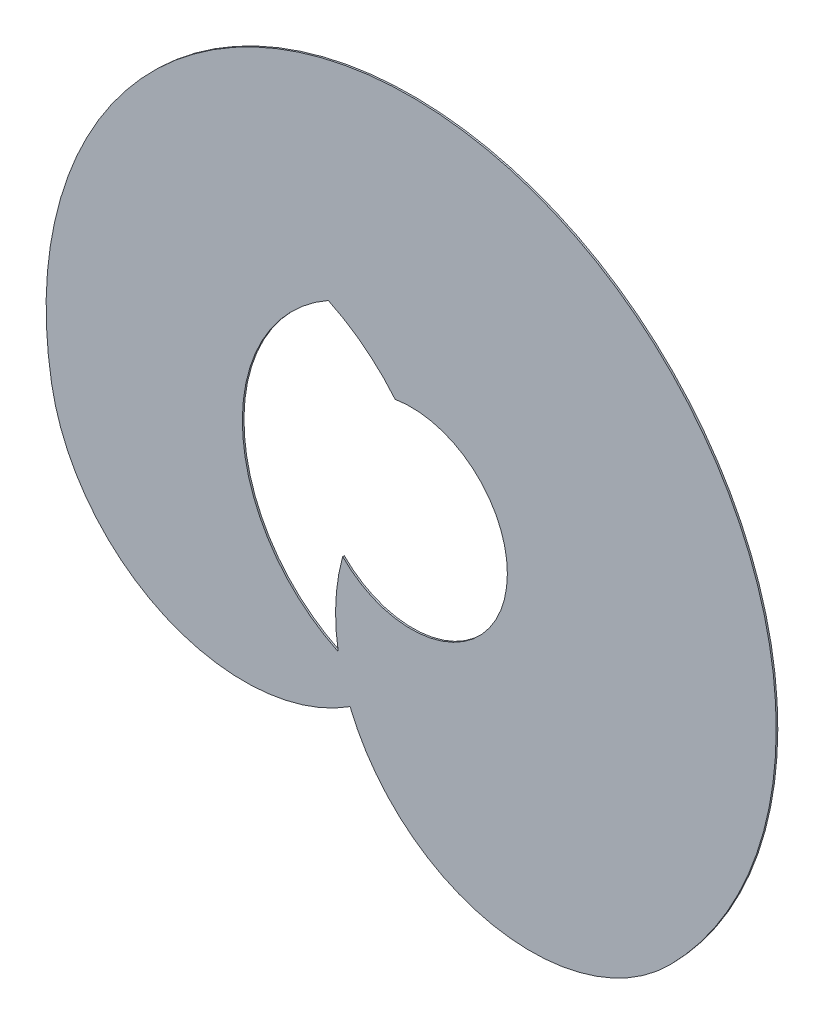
from build123d import *

# Parameters (mm, degrees)
EXTRUDE_START   = -200
EXTRUDE_1_DEPTH = 1.5


with BuildPart() as part:
    # Sketch 1 → Extrude 1 (new, symmetric)
    with BuildSketch(Plane.XY.offset(EXTRUDE_START)):
        with BuildLine():
            ThreePointArc((509.137799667, -84.137799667), (230.885515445, 1052.985430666), (-649.27250215, 281.107565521))
            ThreePointArc((-649.27250215, 281.107565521), (-435.002082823, 8.788798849), (-89.603623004, 36.52374495))
            ThreePointArc((-89.603623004, 36.52374495), (177.422119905, -184.307810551), (509.137799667, -84.137799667))
        make_face()
        with BuildLine():
            ThreePointArc((-103.439777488, 273.269030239), (-116.311771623, 194.330290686), (-111.761636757, 114.47849604))
            ThreePointArc((-111.761636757, 114.47849604), (-291.410163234, 389.469894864), (-130.442271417, 675.796981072))
            ThreePointArc((-130.442271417, 675.796981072), (-62.421660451, 633.723125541), (-5.141903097, 577.901604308))
            ThreePointArc((-5.141903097, 577.901604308), (196.718632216, 344.590375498), (-103.439777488, 273.269030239))
        make_face(mode=Mode.SUBTRACT)
    extrude(amount=EXTRUDE_1_DEPTH, both=True)


solid = part.part
